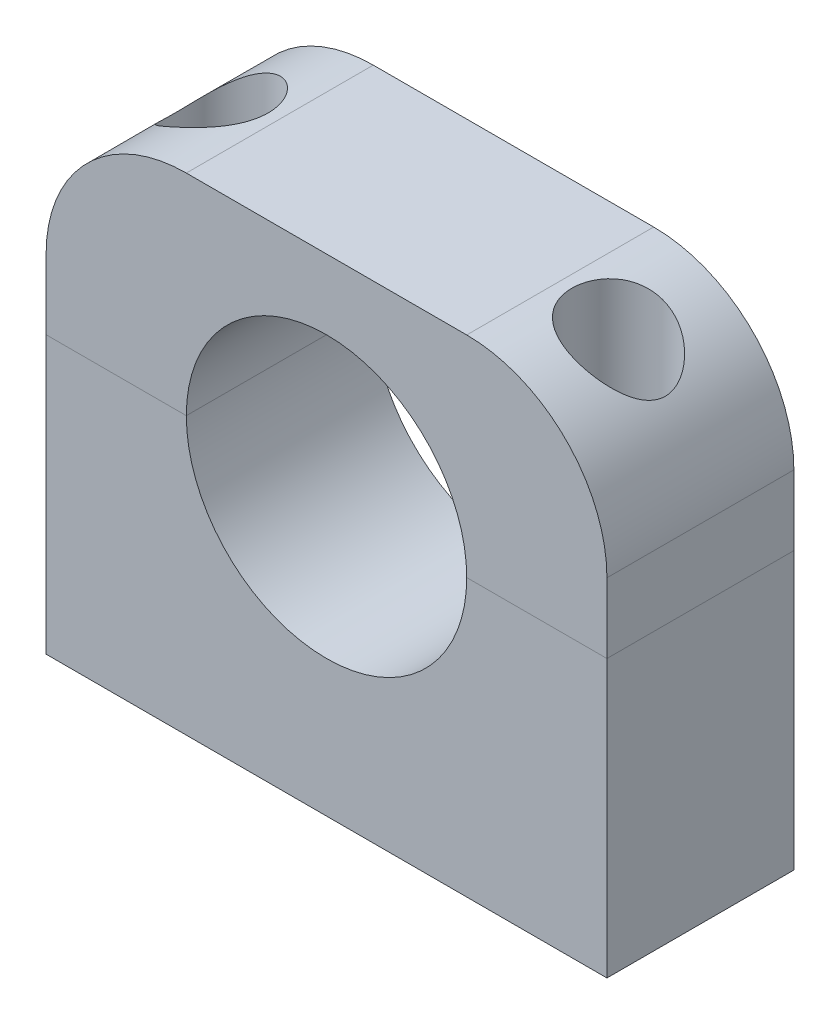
ISO-10303-21;
HEADER;
FILE_DESCRIPTION(('STEP AP214'),'2;1');
FILE_NAME('part.step','',(''),(''),'','','');
FILE_SCHEMA(('AUTOMOTIVE_DESIGN { 1 0 10303 214 1 1 1 1 }'));
ENDSEC;
DATA;
#1=APPLICATION_CONTEXT('core data for automotive mechanical design processes');
#2=APPLICATION_PROTOCOL_DEFINITION('international standard','automotive_design',2000,#1);
#3=PRODUCT_CONTEXT('',#1,'mechanical');
#4=PRODUCT('Part','Part','',(#3));
#5=PRODUCT_RELATED_PRODUCT_CATEGORY('part','',(#4));
#6=PRODUCT_DEFINITION_FORMATION('','',#4);
#7=PRODUCT_DEFINITION_CONTEXT('part definition',#1,'design');
#8=PRODUCT_DEFINITION('design','',#6,#7);
#9=PRODUCT_DEFINITION_SHAPE('','',#8);
#10=(LENGTH_UNIT() NAMED_UNIT(*) SI_UNIT(.MILLI.,.METRE.));
#11=(NAMED_UNIT(*) PLANE_ANGLE_UNIT() SI_UNIT($,.RADIAN.));
#12=(NAMED_UNIT(*) SI_UNIT($,.STERADIAN.) SOLID_ANGLE_UNIT());
#13=UNCERTAINTY_MEASURE_WITH_UNIT(LENGTH_MEASURE(1.E-05),#10,'distance_accuracy_value','');
#14=(GEOMETRIC_REPRESENTATION_CONTEXT(3) GLOBAL_UNCERTAINTY_ASSIGNED_CONTEXT((#13)) GLOBAL_UNIT_ASSIGNED_CONTEXT((#10,
#11,#12)) REPRESENTATION_CONTEXT('',''));
#15=CARTESIAN_POINT('',(0.,0.,0.));
#16=DIRECTION('',(0.,0.,1.));
#17=DIRECTION('',(1.,0.,0.));
#18=AXIS2_PLACEMENT_3D('',#15,#16,#17);
#19=CARTESIAN_POINT('',(-19.05,0.,6.35));
#20=DIRECTION('',(0.,-1.,0.));
#21=DIRECTION('',(1.,0.,0.));
#22=AXIS2_PLACEMENT_3D('',#19,#20,#21);
#23=PLANE('',#22);
#24=DIRECTION('',(-1.,0.,0.));
#25=VECTOR('',#24,1.);
#26=CARTESIAN_POINT('',(-19.05,0.,-6.35));
#27=LINE('',#26,#25);
#28=CARTESIAN_POINT('',(-9.525,0.,-6.35));
#29=VERTEX_POINT('',#28);
#30=CARTESIAN_POINT('',(-19.05,0.,-6.35));
#31=VERTEX_POINT('',#30);
#32=EDGE_CURVE('E130',#29,#31,#27,.T.);
#33=ORIENTED_EDGE('',*,*,#32,.T.);
#34=DIRECTION('',(0.,0.,-1.));
#35=VECTOR('',#34,1.);
#36=CARTESIAN_POINT('',(-19.05,0.,6.35));
#37=LINE('',#36,#35);
#38=CARTESIAN_POINT('',(-19.05,0.,6.35));
#39=VERTEX_POINT('',#38);
#40=EDGE_CURVE('E12',#39,#31,#37,.T.);
#41=ORIENTED_EDGE('',*,*,#40,.F.);
#42=DIRECTION('',(-1.,0.,0.));
#43=VECTOR('',#42,1.);
#44=CARTESIAN_POINT('',(-19.05,0.,6.35));
#45=LINE('',#44,#43);
#46=CARTESIAN_POINT('',(-9.525,0.,6.35));
#47=VERTEX_POINT('',#46);
#48=EDGE_CURVE('E141',#47,#39,#45,.T.);
#49=ORIENTED_EDGE('',*,*,#48,.F.);
#50=DIRECTION('',(0.,0.,-1.));
#51=VECTOR('',#50,1.);
#52=CARTESIAN_POINT('',(-9.525,0.,6.35));
#53=LINE('',#52,#51);
#54=EDGE_CURVE('E126',#47,#29,#53,.T.);
#55=ORIENTED_EDGE('',*,*,#54,.T.);
#56=EDGE_LOOP('',(#33,#41,#49,#55));
#57=FACE_BOUND('',#56,.T.);
#58=CARTESIAN_POINT('',(-13.4874,0.,0.));
#59=DIRECTION('',(0.,-1.,0.));
#60=DIRECTION('',(1.,0.,0.));
#61=AXIS2_PLACEMENT_3D('',#58,#59,#60);
#62=CIRCLE('',#61,3.175);
#63=CARTESIAN_POINT('',(-13.4874,0.,-3.175));
#64=VERTEX_POINT('',#63);
#65=EDGE_CURVE('E134',#64,#64,#62,.F.);
#66=ORIENTED_EDGE('',*,*,#65,.F.);
#67=EDGE_LOOP('',(#66));
#68=FACE_BOUND('',#67,.T.);
#69=ADVANCED_FACE('F43',(#57,#68),#23,.F.);
#70=CARTESIAN_POINT('',(-19.05,-18.796,6.35));
#71=DIRECTION('',(0.,1.,0.));
#72=DIRECTION('',(0.,0.,1.));
#73=AXIS2_PLACEMENT_3D('',#70,#71,#72);
#74=PLANE('',#73);
#75=CARTESIAN_POINT('',(13.4874,-18.796,0.));
#76=DIRECTION('',(0.,1.,0.));
#77=DIRECTION('',(0.,0.,1.));
#78=AXIS2_PLACEMENT_3D('',#75,#76,#77);
#79=CIRCLE('',#78,3.175);
#80=CARTESIAN_POINT('',(13.4874,-18.796,-3.175));
#81=VERTEX_POINT('',#80);
#82=EDGE_CURVE('E148',#81,#81,#79,.F.);
#83=ORIENTED_EDGE('',*,*,#82,.F.);
#84=EDGE_LOOP('',(#83));
#85=FACE_BOUND('',#84,.T.);
#86=DIRECTION('',(1.,0.,0.));
#87=VECTOR('',#86,1.);
#88=CARTESIAN_POINT('',(-19.05,-18.796,-6.35));
#89=LINE('',#88,#87);
#90=CARTESIAN_POINT('',(-19.05,-18.796,-6.35));
#91=VERTEX_POINT('',#90);
#92=CARTESIAN_POINT('',(19.05,-18.796,-6.35));
#93=VERTEX_POINT('',#92);
#94=EDGE_CURVE('E136',#91,#93,#89,.T.);
#95=ORIENTED_EDGE('',*,*,#94,.T.);
#96=DIRECTION('',(0.,0.,-1.));
#97=VECTOR('',#96,1.);
#98=CARTESIAN_POINT('',(19.05,-18.796,6.35));
#99=LINE('',#98,#97);
#100=CARTESIAN_POINT('',(19.05,-18.796,6.35));
#101=VERTEX_POINT('',#100);
#102=EDGE_CURVE('E120',#101,#93,#99,.T.);
#103=ORIENTED_EDGE('',*,*,#102,.F.);
#104=DIRECTION('',(1.,0.,0.));
#105=VECTOR('',#104,1.);
#106=CARTESIAN_POINT('',(-19.05,-18.796,6.35));
#107=LINE('',#106,#105);
#108=CARTESIAN_POINT('',(-19.05,-18.796,6.35));
#109=VERTEX_POINT('',#108);
#110=EDGE_CURVE('E111',#109,#101,#107,.T.);
#111=ORIENTED_EDGE('',*,*,#110,.F.);
#112=DIRECTION('',(0.,0.,-1.));
#113=VECTOR('',#112,1.);
#114=CARTESIAN_POINT('',(-19.05,-18.796,6.35));
#115=LINE('',#114,#113);
#116=EDGE_CURVE('E52',#109,#91,#115,.T.);
#117=ORIENTED_EDGE('',*,*,#116,.T.);
#118=EDGE_LOOP('',(#95,#103,#111,#117));
#119=FACE_BOUND('',#118,.T.);
#120=CARTESIAN_POINT('',(-13.4874,-18.796,0.));
#121=DIRECTION('',(0.,1.,0.));
#122=DIRECTION('',(0.,0.,1.));
#123=AXIS2_PLACEMENT_3D('',#120,#121,#122);
#124=CIRCLE('',#123,3.175);
#125=CARTESIAN_POINT('',(-13.4874,-18.796,-3.175));
#126=VERTEX_POINT('',#125);
#127=EDGE_CURVE('E46',#126,#126,#124,.F.);
#128=ORIENTED_EDGE('',*,*,#127,.F.);
#129=EDGE_LOOP('',(#128));
#130=FACE_BOUND('',#129,.T.);
#131=ADVANCED_FACE('F165',(#85,#119,#130),#74,.F.);
#132=CARTESIAN_POINT('',(9.525,0.,6.35));
#133=DIRECTION('',(0.,-1.,0.));
#134=DIRECTION('',(1.,0.,0.));
#135=AXIS2_PLACEMENT_3D('',#132,#133,#134);
#136=PLANE('',#135);
#137=DIRECTION('',(-1.,0.,0.));
#138=VECTOR('',#137,1.);
#139=CARTESIAN_POINT('',(9.525,0.,-6.35));
#140=LINE('',#139,#138);
#141=CARTESIAN_POINT('',(19.05,0.,-6.35));
#142=VERTEX_POINT('',#141);
#143=CARTESIAN_POINT('',(9.525,0.,-6.35));
#144=VERTEX_POINT('',#143);
#145=EDGE_CURVE('E84',#142,#144,#140,.T.);
#146=ORIENTED_EDGE('',*,*,#145,.T.);
#147=DIRECTION('',(0.,0.,-1.));
#148=VECTOR('',#147,1.);
#149=CARTESIAN_POINT('',(9.525,0.,6.35));
#150=LINE('',#149,#148);
#151=CARTESIAN_POINT('',(9.525,0.,6.35));
#152=VERTEX_POINT('',#151);
#153=EDGE_CURVE('E121',#152,#144,#150,.T.);
#154=ORIENTED_EDGE('',*,*,#153,.F.);
#155=DIRECTION('',(-1.,0.,0.));
#156=VECTOR('',#155,1.);
#157=CARTESIAN_POINT('',(9.525,0.,6.35));
#158=LINE('',#157,#156);
#159=CARTESIAN_POINT('',(19.05,0.,6.35));
#160=VERTEX_POINT('',#159);
#161=EDGE_CURVE('E109',#160,#152,#158,.T.);
#162=ORIENTED_EDGE('',*,*,#161,.F.);
#163=DIRECTION('',(0.,0.,-1.));
#164=VECTOR('',#163,1.);
#165=CARTESIAN_POINT('',(19.05,0.,6.35));
#166=LINE('',#165,#164);
#167=EDGE_CURVE('E116',#160,#142,#166,.T.);
#168=ORIENTED_EDGE('',*,*,#167,.T.);
#169=EDGE_LOOP('',(#146,#154,#162,#168));
#170=FACE_BOUND('',#169,.T.);
#171=CARTESIAN_POINT('',(13.4874,0.,0.));
#172=DIRECTION('',(0.,-1.,0.));
#173=DIRECTION('',(1.,0.,0.));
#174=AXIS2_PLACEMENT_3D('',#171,#172,#173);
#175=CIRCLE('',#174,3.175);
#176=CARTESIAN_POINT('',(13.4874,0.,-3.175));
#177=VERTEX_POINT('',#176);
#178=EDGE_CURVE('E146',#177,#177,#175,.F.);
#179=ORIENTED_EDGE('',*,*,#178,.F.);
#180=EDGE_LOOP('',(#179));
#181=FACE_BOUND('',#180,.T.);
#182=ADVANCED_FACE('F123',(#170,#181),#136,.F.);
#183=CARTESIAN_POINT('',(-19.05,0.,6.35));
#184=DIRECTION('',(1.,0.,0.));
#185=DIRECTION('',(0.,0.,-1.));
#186=AXIS2_PLACEMENT_3D('',#183,#184,#185);
#187=PLANE('',#186);
#188=DIRECTION('',(0.,-1.,0.));
#189=VECTOR('',#188,1.);
#190=CARTESIAN_POINT('',(-19.05,0.,-6.35));
#191=LINE('',#190,#189);
#192=EDGE_CURVE('E133',#31,#91,#191,.T.);
#193=ORIENTED_EDGE('',*,*,#192,.T.);
#194=ORIENTED_EDGE('',*,*,#116,.F.);
#195=DIRECTION('',(0.,-1.,0.));
#196=VECTOR('',#195,1.);
#197=CARTESIAN_POINT('',(-19.05,0.,6.35));
#198=LINE('',#197,#196);
#199=EDGE_CURVE('E98',#39,#109,#198,.T.);
#200=ORIENTED_EDGE('',*,*,#199,.F.);
#201=ORIENTED_EDGE('',*,*,#40,.T.);
#202=EDGE_LOOP('',(#193,#194,#200,#201));
#203=FACE_BOUND('',#202,.T.);
#204=ADVANCED_FACE('F162',(#203),#187,.F.);
#205=CARTESIAN_POINT('',(19.05,-18.796,6.35));
#206=DIRECTION('',(-1.,0.,0.));
#207=DIRECTION('',(0.,0.,1.));
#208=AXIS2_PLACEMENT_3D('',#205,#206,#207);
#209=PLANE('',#208);
#210=DIRECTION('',(0.,1.,0.));
#211=VECTOR('',#210,1.);
#212=CARTESIAN_POINT('',(19.05,-18.796,-6.35));
#213=LINE('',#212,#211);
#214=EDGE_CURVE('E119',#93,#142,#213,.T.);
#215=ORIENTED_EDGE('',*,*,#214,.T.);
#216=ORIENTED_EDGE('',*,*,#167,.F.);
#217=DIRECTION('',(0.,1.,0.));
#218=VECTOR('',#217,1.);
#219=CARTESIAN_POINT('',(19.05,-18.796,6.35));
#220=LINE('',#219,#218);
#221=EDGE_CURVE('E105',#101,#160,#220,.T.);
#222=ORIENTED_EDGE('',*,*,#221,.F.);
#223=ORIENTED_EDGE('',*,*,#102,.T.);
#224=EDGE_LOOP('',(#215,#216,#222,#223));
#225=FACE_BOUND('',#224,.T.);
#226=ADVANCED_FACE('F117',(#225),#209,.F.);
#227=CARTESIAN_POINT('',(0.,0.,6.35));
#228=DIRECTION('',(0.,0.,-1.));
#229=DIRECTION('',(-1.,0.,0.));
#230=AXIS2_PLACEMENT_3D('',#227,#228,#229);
#231=CYLINDRICAL_SURFACE('',#230,9.525);
#232=CARTESIAN_POINT('',(0.,0.,-6.35));
#233=DIRECTION('',(0.,0.,-1.));
#234=DIRECTION('',(1.,0.,0.));
#235=AXIS2_PLACEMENT_3D('',#232,#233,#234);
#236=CIRCLE('',#235,9.525);
#237=EDGE_CURVE('E90',#144,#29,#236,.T.);
#238=ORIENTED_EDGE('',*,*,#237,.T.);
#239=ORIENTED_EDGE('',*,*,#54,.F.);
#240=CARTESIAN_POINT('',(0.,0.,6.35));
#241=DIRECTION('',(0.,0.,-1.));
#242=DIRECTION('',(1.,0.,0.));
#243=AXIS2_PLACEMENT_3D('',#240,#241,#242);
#244=CIRCLE('',#243,9.525);
#245=EDGE_CURVE('E61',#152,#47,#244,.T.);
#246=ORIENTED_EDGE('',*,*,#245,.F.);
#247=ORIENTED_EDGE('',*,*,#153,.T.);
#248=EDGE_LOOP('',(#238,#239,#246,#247));
#249=FACE_BOUND('',#248,.T.);
#250=ADVANCED_FACE('F172',(#249),#231,.F.);
#251=CARTESIAN_POINT('',(0.,0.,6.35));
#252=DIRECTION('',(0.,0.,1.));
#253=DIRECTION('',(1.,0.,0.));
#254=AXIS2_PLACEMENT_3D('',#251,#252,#253);
#255=PLANE('',#254);
#256=ORIENTED_EDGE('',*,*,#48,.T.);
#257=ORIENTED_EDGE('',*,*,#199,.T.);
#258=ORIENTED_EDGE('',*,*,#110,.T.);
#259=ORIENTED_EDGE('',*,*,#221,.T.);
#260=ORIENTED_EDGE('',*,*,#161,.T.);
#261=ORIENTED_EDGE('',*,*,#245,.T.);
#262=EDGE_LOOP('',(#256,#257,#258,#259,#260,#261));
#263=FACE_BOUND('',#262,.T.);
#264=ADVANCED_FACE('F107',(#263),#255,.T.);
#265=CARTESIAN_POINT('',(0.,0.,-6.35));
#266=DIRECTION('',(0.,0.,1.));
#267=DIRECTION('',(1.,0.,0.));
#268=AXIS2_PLACEMENT_3D('',#265,#266,#267);
#269=PLANE('',#268);
#270=ORIENTED_EDGE('',*,*,#32,.F.);
#271=ORIENTED_EDGE('',*,*,#237,.F.);
#272=ORIENTED_EDGE('',*,*,#145,.F.);
#273=ORIENTED_EDGE('',*,*,#214,.F.);
#274=ORIENTED_EDGE('',*,*,#94,.F.);
#275=ORIENTED_EDGE('',*,*,#192,.F.);
#276=EDGE_LOOP('',(#270,#271,#272,#273,#274,#275));
#277=FACE_BOUND('',#276,.T.);
#278=ADVANCED_FACE('F169',(#277),#269,.F.);
#279=CARTESIAN_POINT('',(13.4874,17.78,0.));
#280=DIRECTION('',(0.,-1.,0.));
#281=DIRECTION('',(0.,0.,-1.));
#282=AXIS2_PLACEMENT_3D('',#279,#280,#281);
#283=CYLINDRICAL_SURFACE('',#282,3.175);
#284=CARTESIAN_POINT('',(13.4874,0.,-3.175));
#285=CARTESIAN_POINT('',(13.4874,-0.195791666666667,-3.175));
#286=CARTESIAN_POINT('',(13.4874,-0.391583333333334,-3.175));
#287=CARTESIAN_POINT('',(13.4874,-0.783166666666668,-3.175));
#288=CARTESIAN_POINT('',(13.4874,-0.978958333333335,-3.175));
#289=CARTESIAN_POINT('',(13.4874,-1.37054166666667,-3.175));
#290=CARTESIAN_POINT('',(13.4874,-1.56633333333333,-3.175));
#291=CARTESIAN_POINT('',(13.4874,-1.95791666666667,-3.175));
#292=CARTESIAN_POINT('',(13.4874,-2.15370833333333,-3.175));
#293=CARTESIAN_POINT('',(13.4874,-2.54529166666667,-3.175));
#294=CARTESIAN_POINT('',(13.4874,-2.74108333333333,-3.175));
#295=CARTESIAN_POINT('',(13.4874,-3.13266666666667,-3.175));
#296=CARTESIAN_POINT('',(13.4874,-3.32845833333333,-3.175));
#297=CARTESIAN_POINT('',(13.4874,-3.72004166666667,-3.175));
#298=CARTESIAN_POINT('',(13.4874,-3.91583333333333,-3.175));
#299=CARTESIAN_POINT('',(13.4874,-4.30741666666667,-3.175));
#300=CARTESIAN_POINT('',(13.4874,-4.50320833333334,-3.175));
#301=CARTESIAN_POINT('',(13.4874,-4.89479166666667,-3.175));
#302=CARTESIAN_POINT('',(13.4874,-5.09058333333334,-3.175));
#303=CARTESIAN_POINT('',(13.4874,-5.48216666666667,-3.175));
#304=CARTESIAN_POINT('',(13.4874,-5.67795833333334,-3.175));
#305=CARTESIAN_POINT('',(13.4874,-6.06954166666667,-3.175));
#306=CARTESIAN_POINT('',(13.4874,-6.26533333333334,-3.175));
#307=CARTESIAN_POINT('',(13.4874,-6.65691666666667,-3.175));
#308=CARTESIAN_POINT('',(13.4874,-6.85270833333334,-3.175));
#309=CARTESIAN_POINT('',(13.4874,-7.24429166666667,-3.175));
#310=CARTESIAN_POINT('',(13.4874,-7.44008333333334,-3.175));
#311=CARTESIAN_POINT('',(13.4874,-7.83166666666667,-3.175));
#312=CARTESIAN_POINT('',(13.4874,-8.02745833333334,-3.175));
#313=CARTESIAN_POINT('',(13.4874,-8.41904166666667,-3.175));
#314=CARTESIAN_POINT('',(13.4874,-8.61483333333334,-3.175));
#315=CARTESIAN_POINT('',(13.4874,-9.00641666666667,-3.175));
#316=CARTESIAN_POINT('',(13.4874,-9.20220833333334,-3.175));
#317=CARTESIAN_POINT('',(13.4874,-9.59379166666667,-3.175));
#318=CARTESIAN_POINT('',(13.4874,-9.78958333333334,-3.175));
#319=CARTESIAN_POINT('',(13.4874,-10.1811666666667,-3.175));
#320=CARTESIAN_POINT('',(13.4874,-10.3769583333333,-3.175));
#321=CARTESIAN_POINT('',(13.4874,-10.7685416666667,-3.175));
#322=CARTESIAN_POINT('',(13.4874,-10.9643333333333,-3.175));
#323=CARTESIAN_POINT('',(13.4874,-11.3559166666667,-3.175));
#324=CARTESIAN_POINT('',(13.4874,-11.5517083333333,-3.175));
#325=CARTESIAN_POINT('',(13.4874,-11.9432916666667,-3.175));
#326=CARTESIAN_POINT('',(13.4874,-12.1390833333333,-3.175));
#327=CARTESIAN_POINT('',(13.4874,-12.5306666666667,-3.175));
#328=CARTESIAN_POINT('',(13.4874,-12.7264583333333,-3.175));
#329=CARTESIAN_POINT('',(13.4874,-13.1180416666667,-3.175));
#330=CARTESIAN_POINT('',(13.4874,-13.3138333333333,-3.175));
#331=CARTESIAN_POINT('',(13.4874,-13.7054166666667,-3.175));
#332=CARTESIAN_POINT('',(13.4874,-13.9012083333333,-3.175));
#333=CARTESIAN_POINT('',(13.4874,-14.2927916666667,-3.175));
#334=CARTESIAN_POINT('',(13.4874,-14.4885833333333,-3.175));
#335=CARTESIAN_POINT('',(13.4874,-14.8801666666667,-3.175));
#336=CARTESIAN_POINT('',(13.4874,-15.0759583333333,-3.175));
#337=CARTESIAN_POINT('',(13.4874,-15.4675416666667,-3.175));
#338=CARTESIAN_POINT('',(13.4874,-15.6633333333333,-3.175));
#339=CARTESIAN_POINT('',(13.4874,-16.0549166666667,-3.175));
#340=CARTESIAN_POINT('',(13.4874,-16.2507083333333,-3.175));
#341=CARTESIAN_POINT('',(13.4874,-16.6422916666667,-3.175));
#342=CARTESIAN_POINT('',(13.4874,-16.8380833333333,-3.175));
#343=CARTESIAN_POINT('',(13.4874,-17.2296666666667,-3.175));
#344=CARTESIAN_POINT('',(13.4874,-17.4254583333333,-3.175));
#345=CARTESIAN_POINT('',(13.4874,-17.8170416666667,-3.175));
#346=CARTESIAN_POINT('',(13.4874,-18.0128333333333,-3.175));
#347=CARTESIAN_POINT('',(13.4874,-18.4044166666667,-3.175));
#348=CARTESIAN_POINT('',(13.4874,-18.6002083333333,-3.175));
#349=CARTESIAN_POINT('',(13.4874,-18.796,-3.175));
#350=B_SPLINE_CURVE_WITH_KNOTS('',3,(#284,#285,#286,#287,#288,#289,#290,#291,#292,#293,#294,
#295,#296,#297,#298,#299,#300,#301,#302,#303,#304,#305,#306,#307,#308,#309,#310,#311,#312,#313,
#314,#315,#316,#317,#318,#319,#320,#321,#322,#323,#324,#325,#326,#327,#328,#329,#330,#331,#332,
#333,#334,#335,#336,#337,#338,#339,#340,#341,#342,#343,#344,#345,#346,#347,#348,#349),
.UNSPECIFIED.,.F.,.F.,(4,2,2,2,2,2,2,2,2,2,2,2,2,2,2,2,2,2,2,2,2,2,2,2,2,2,2,2,2,2,2,2,4),(0.,
0.587375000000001,1.17475,1.762125,2.3495,2.936875,3.52425,4.111625,4.699,5.286375,5.87375,
6.461125,7.0485,7.635875,8.22325,8.810625,9.398,9.985375,10.57275,11.160125,11.7475,12.334875,
12.92225,13.509625,14.097,14.684375,15.27175,15.859125,16.4465,17.033875,17.62125,18.208625,
18.796),.UNSPECIFIED.);
#351=EDGE_CURVE('BSEAM219',#177,#81,#350,.T.);
#352=ORIENTED_EDGE('',*,*,#178,.T.);
#353=ORIENTED_EDGE('',*,*,#82,.T.);
#354=ORIENTED_EDGE('',*,*,#351,.T.);
#355=ORIENTED_EDGE('',*,*,#351,.F.);
#356=EDGE_LOOP('',(#352,#354,#353,#355));
#357=FACE_BOUND('',#356,.T.);
#358=ADVANCED_FACE('F219',(#357),#283,.F.);
#359=CARTESIAN_POINT('',(-13.4874,17.78,0.));
#360=DIRECTION('',(0.,-1.,0.));
#361=DIRECTION('',(0.,0.,-1.));
#362=AXIS2_PLACEMENT_3D('',#359,#360,#361);
#363=CYLINDRICAL_SURFACE('',#362,3.175);
#364=CARTESIAN_POINT('',(-13.4874,-18.796,-3.175));
#365=CARTESIAN_POINT('',(-13.4874,-18.6002083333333,-3.175));
#366=CARTESIAN_POINT('',(-13.4874,-18.4044166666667,-3.175));
#367=CARTESIAN_POINT('',(-13.4874,-18.0128333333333,-3.175));
#368=CARTESIAN_POINT('',(-13.4874,-17.8170416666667,-3.175));
#369=CARTESIAN_POINT('',(-13.4874,-17.4254583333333,-3.175));
#370=CARTESIAN_POINT('',(-13.4874,-17.2296666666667,-3.175));
#371=CARTESIAN_POINT('',(-13.4874,-16.8380833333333,-3.175));
#372=CARTESIAN_POINT('',(-13.4874,-16.6422916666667,-3.175));
#373=CARTESIAN_POINT('',(-13.4874,-16.2507083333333,-3.175));
#374=CARTESIAN_POINT('',(-13.4874,-16.0549166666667,-3.175));
#375=CARTESIAN_POINT('',(-13.4874,-15.6633333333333,-3.175));
#376=CARTESIAN_POINT('',(-13.4874,-15.4675416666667,-3.175));
#377=CARTESIAN_POINT('',(-13.4874,-15.0759583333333,-3.175));
#378=CARTESIAN_POINT('',(-13.4874,-14.8801666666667,-3.175));
#379=CARTESIAN_POINT('',(-13.4874,-14.4885833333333,-3.175));
#380=CARTESIAN_POINT('',(-13.4874,-14.2927916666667,-3.175));
#381=CARTESIAN_POINT('',(-13.4874,-13.9012083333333,-3.175));
#382=CARTESIAN_POINT('',(-13.4874,-13.7054166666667,-3.175));
#383=CARTESIAN_POINT('',(-13.4874,-13.3138333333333,-3.175));
#384=CARTESIAN_POINT('',(-13.4874,-13.1180416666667,-3.175));
#385=CARTESIAN_POINT('',(-13.4874,-12.7264583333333,-3.175));
#386=CARTESIAN_POINT('',(-13.4874,-12.5306666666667,-3.175));
#387=CARTESIAN_POINT('',(-13.4874,-12.1390833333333,-3.175));
#388=CARTESIAN_POINT('',(-13.4874,-11.9432916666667,-3.175));
#389=CARTESIAN_POINT('',(-13.4874,-11.5517083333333,-3.175));
#390=CARTESIAN_POINT('',(-13.4874,-11.3559166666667,-3.175));
#391=CARTESIAN_POINT('',(-13.4874,-10.9643333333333,-3.175));
#392=CARTESIAN_POINT('',(-13.4874,-10.7685416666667,-3.175));
#393=CARTESIAN_POINT('',(-13.4874,-10.3769583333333,-3.175));
#394=CARTESIAN_POINT('',(-13.4874,-10.1811666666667,-3.175));
#395=CARTESIAN_POINT('',(-13.4874,-9.78958333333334,-3.175));
#396=CARTESIAN_POINT('',(-13.4874,-9.59379166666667,-3.175));
#397=CARTESIAN_POINT('',(-13.4874,-9.20220833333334,-3.175));
#398=CARTESIAN_POINT('',(-13.4874,-9.00641666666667,-3.175));
#399=CARTESIAN_POINT('',(-13.4874,-8.61483333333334,-3.175));
#400=CARTESIAN_POINT('',(-13.4874,-8.41904166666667,-3.175));
#401=CARTESIAN_POINT('',(-13.4874,-8.02745833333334,-3.175));
#402=CARTESIAN_POINT('',(-13.4874,-7.83166666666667,-3.175));
#403=CARTESIAN_POINT('',(-13.4874,-7.44008333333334,-3.175));
#404=CARTESIAN_POINT('',(-13.4874,-7.24429166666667,-3.175));
#405=CARTESIAN_POINT('',(-13.4874,-6.85270833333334,-3.175));
#406=CARTESIAN_POINT('',(-13.4874,-6.65691666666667,-3.175));
#407=CARTESIAN_POINT('',(-13.4874,-6.26533333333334,-3.175));
#408=CARTESIAN_POINT('',(-13.4874,-6.06954166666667,-3.175));
#409=CARTESIAN_POINT('',(-13.4874,-5.67795833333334,-3.175));
#410=CARTESIAN_POINT('',(-13.4874,-5.48216666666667,-3.175));
#411=CARTESIAN_POINT('',(-13.4874,-5.09058333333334,-3.175));
#412=CARTESIAN_POINT('',(-13.4874,-4.89479166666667,-3.175));
#413=CARTESIAN_POINT('',(-13.4874,-4.50320833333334,-3.175));
#414=CARTESIAN_POINT('',(-13.4874,-4.30741666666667,-3.175));
#415=CARTESIAN_POINT('',(-13.4874,-3.91583333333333,-3.175));
#416=CARTESIAN_POINT('',(-13.4874,-3.72004166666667,-3.175));
#417=CARTESIAN_POINT('',(-13.4874,-3.32845833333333,-3.175));
#418=CARTESIAN_POINT('',(-13.4874,-3.13266666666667,-3.175));
#419=CARTESIAN_POINT('',(-13.4874,-2.74108333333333,-3.175));
#420=CARTESIAN_POINT('',(-13.4874,-2.54529166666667,-3.175));
#421=CARTESIAN_POINT('',(-13.4874,-2.15370833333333,-3.175));
#422=CARTESIAN_POINT('',(-13.4874,-1.95791666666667,-3.175));
#423=CARTESIAN_POINT('',(-13.4874,-1.56633333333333,-3.175));
#424=CARTESIAN_POINT('',(-13.4874,-1.37054166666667,-3.175));
#425=CARTESIAN_POINT('',(-13.4874,-0.978958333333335,-3.175));
#426=CARTESIAN_POINT('',(-13.4874,-0.783166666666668,-3.175));
#427=CARTESIAN_POINT('',(-13.4874,-0.391583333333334,-3.175));
#428=CARTESIAN_POINT('',(-13.4874,-0.195791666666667,-3.175));
#429=CARTESIAN_POINT('',(-13.4874,0.,-3.175));
#430=B_SPLINE_CURVE_WITH_KNOTS('',3,(#364,#365,#366,#367,#368,#369,#370,#371,#372,#373,#374,
#375,#376,#377,#378,#379,#380,#381,#382,#383,#384,#385,#386,#387,#388,#389,#390,#391,#392,#393,
#394,#395,#396,#397,#398,#399,#400,#401,#402,#403,#404,#405,#406,#407,#408,#409,#410,#411,#412,
#413,#414,#415,#416,#417,#418,#419,#420,#421,#422,#423,#424,#425,#426,#427,#428,#429),
.UNSPECIFIED.,.F.,.F.,(4,2,2,2,2,2,2,2,2,2,2,2,2,2,2,2,2,2,2,2,2,2,2,2,2,2,2,2,2,2,2,2,4),(0.,
0.587375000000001,1.17475,1.762125,2.3495,2.936875,3.52425,4.111625,4.699,5.286375,5.87375,
6.461125,7.0485,7.635875,8.22325,8.810625,9.398,9.985375,10.57275,11.160125,11.7475,12.334875,
12.92225,13.509625,14.097,14.684375,15.27175,15.859125,16.4465,17.033875,17.62125,18.208625,
18.796),.UNSPECIFIED.);
#431=EDGE_CURVE('BSEAM240',#126,#64,#430,.T.);
#432=ORIENTED_EDGE('',*,*,#127,.T.);
#433=ORIENTED_EDGE('',*,*,#65,.T.);
#434=ORIENTED_EDGE('',*,*,#431,.T.);
#435=ORIENTED_EDGE('',*,*,#431,.F.);
#436=EDGE_LOOP('',(#432,#434,#433,#435));
#437=FACE_BOUND('',#436,.T.);
#438=ADVANCED_FACE('F240',(#437),#363,.F.);
#439=CLOSED_SHELL('',(#69,#131,#182,#204,#226,#250,#264,#278,#358,#438));
#440=MANIFOLD_SOLID_BREP('B2',#439);
#441=CARTESIAN_POINT('',(-19.05,0.,6.35));
#442=DIRECTION('',(0.,1.,0.));
#443=DIRECTION('',(-1.,0.,0.));
#444=AXIS2_PLACEMENT_3D('',#441,#442,#443);
#445=PLANE('',#444);
#446=DIRECTION('',(1.,0.,0.));
#447=VECTOR('',#446,1.);
#448=CARTESIAN_POINT('',(-19.05,0.,-6.35));
#449=LINE('',#448,#447);
#450=CARTESIAN_POINT('',(-19.05,0.,-6.35));
#451=VERTEX_POINT('',#450);
#452=CARTESIAN_POINT('',(-9.525,0.,-6.35));
#453=VERTEX_POINT('',#452);
#454=EDGE_CURVE('E508',#451,#453,#449,.T.);
#455=ORIENTED_EDGE('',*,*,#454,.T.);
#456=DIRECTION('',(0.,0.,-1.));
#457=VECTOR('',#456,1.);
#458=CARTESIAN_POINT('',(-9.525,0.,6.35));
#459=LINE('',#458,#457);
#460=CARTESIAN_POINT('',(-9.525,0.,6.35));
#461=VERTEX_POINT('',#460);
#462=EDGE_CURVE('E347',#461,#453,#459,.T.);
#463=ORIENTED_EDGE('',*,*,#462,.F.);
#464=DIRECTION('',(1.,0.,0.));
#465=VECTOR('',#464,1.);
#466=CARTESIAN_POINT('',(-19.05,0.,6.35));
#467=LINE('',#466,#465);
#468=CARTESIAN_POINT('',(-19.05,0.,6.35));
#469=VERTEX_POINT('',#468);
#470=EDGE_CURVE('E335',#469,#461,#467,.T.);
#471=ORIENTED_EDGE('',*,*,#470,.F.);
#472=DIRECTION('',(0.,0.,-1.));
#473=VECTOR('',#472,1.);
#474=CARTESIAN_POINT('',(-19.05,0.,6.35));
#475=LINE('',#474,#473);
#476=EDGE_CURVE('E345',#469,#451,#475,.T.);
#477=ORIENTED_EDGE('',*,*,#476,.T.);
#478=EDGE_LOOP('',(#455,#463,#471,#477));
#479=FACE_BOUND('',#478,.T.);
#480=CARTESIAN_POINT('',(-13.4874,0.,0.));
#481=DIRECTION('',(0.,1.,0.));
#482=DIRECTION('',(-1.,0.,0.));
#483=AXIS2_PLACEMENT_3D('',#480,#481,#482);
#484=CIRCLE('',#483,3.175);
#485=CARTESIAN_POINT('',(-16.6624,0.,0.));
#486=VERTEX_POINT('',#485);
#487=EDGE_CURVE('E491',#486,#486,#484,.F.);
#488=ORIENTED_EDGE('',*,*,#487,.F.);
#489=EDGE_LOOP('',(#488));
#490=FACE_BOUND('',#489,.T.);
#491=ADVANCED_FACE('F261',(#479,#490),#445,.F.);
#492=CARTESIAN_POINT('',(9.525,0.,6.35));
#493=DIRECTION('',(0.,1.,0.));
#494=DIRECTION('',(-1.,0.,0.));
#495=AXIS2_PLACEMENT_3D('',#492,#493,#494);
#496=PLANE('',#495);
#497=DIRECTION('',(1.,0.,0.));
#498=VECTOR('',#497,1.);
#499=CARTESIAN_POINT('',(9.525,0.,-6.35));
#500=LINE('',#499,#498);
#501=CARTESIAN_POINT('',(9.525,0.,-6.35));
#502=VERTEX_POINT('',#501);
#503=CARTESIAN_POINT('',(19.05,0.,-6.35));
#504=VERTEX_POINT('',#503);
#505=EDGE_CURVE('E512',#502,#504,#500,.T.);
#506=ORIENTED_EDGE('',*,*,#505,.T.);
#507=DIRECTION('',(0.,0.,-1.));
#508=VECTOR('',#507,1.);
#509=CARTESIAN_POINT('',(19.05,0.,6.35));
#510=LINE('',#509,#508);
#511=CARTESIAN_POINT('',(19.05,0.,6.35));
#512=VERTEX_POINT('',#511);
#513=EDGE_CURVE('E506',#512,#504,#510,.T.);
#514=ORIENTED_EDGE('',*,*,#513,.F.);
#515=DIRECTION('',(1.,0.,0.));
#516=VECTOR('',#515,1.);
#517=CARTESIAN_POINT('',(9.525,0.,6.35));
#518=LINE('',#517,#516);
#519=CARTESIAN_POINT('',(9.525,0.,6.35));
#520=VERTEX_POINT('',#519);
#521=EDGE_CURVE('E500',#520,#512,#518,.T.);
#522=ORIENTED_EDGE('',*,*,#521,.F.);
#523=DIRECTION('',(0.,0.,-1.));
#524=VECTOR('',#523,1.);
#525=CARTESIAN_POINT('',(9.525,0.,6.35));
#526=LINE('',#525,#524);
#527=EDGE_CURVE('E359',#520,#502,#526,.T.);
#528=ORIENTED_EDGE('',*,*,#527,.T.);
#529=EDGE_LOOP('',(#506,#514,#522,#528));
#530=FACE_BOUND('',#529,.T.);
#531=CARTESIAN_POINT('',(13.4874,0.,0.));
#532=DIRECTION('',(0.,1.,0.));
#533=DIRECTION('',(-1.,0.,0.));
#534=AXIS2_PLACEMENT_3D('',#531,#532,#533);
#535=CIRCLE('',#534,3.175);
#536=CARTESIAN_POINT('',(10.3124,0.,0.));
#537=VERTEX_POINT('',#536);
#538=EDGE_CURVE('E376',#537,#537,#535,.F.);
#539=ORIENTED_EDGE('',*,*,#538,.F.);
#540=EDGE_LOOP('',(#539));
#541=FACE_BOUND('',#540,.T.);
#542=ADVANCED_FACE('F392',(#530,#541),#496,.F.);
#543=CARTESIAN_POINT('',(19.05,14.2748,6.35));
#544=DIRECTION('',(0.,-1.,0.));
#545=DIRECTION('',(1.,0.,0.));
#546=AXIS2_PLACEMENT_3D('',#543,#544,#545);
#547=PLANE('',#546);
#548=DIRECTION('',(-1.,0.,0.));
#549=VECTOR('',#548,1.);
#550=CARTESIAN_POINT('',(19.05,14.2748,6.35));
#551=LINE('',#550,#549);
#552=CARTESIAN_POINT('',(9.525,14.2748,6.35));
#553=VERTEX_POINT('',#552);
#554=CARTESIAN_POINT('',(-9.525,14.2748,6.35));
#555=VERTEX_POINT('',#554);
#556=EDGE_CURVE('E504',#553,#555,#551,.T.);
#557=ORIENTED_EDGE('',*,*,#556,.F.);
#558=DIRECTION('',(0.,0.,-1.));
#559=VECTOR('',#558,1.);
#560=CARTESIAN_POINT('',(9.525,14.2748,6.35));
#561=LINE('',#560,#559);
#562=CARTESIAN_POINT('',(9.525,14.2748,-6.35));
#563=VERTEX_POINT('',#562);
#564=EDGE_CURVE('E357',#553,#563,#561,.T.);
#565=ORIENTED_EDGE('',*,*,#564,.T.);
#566=DIRECTION('',(-1.,0.,0.));
#567=VECTOR('',#566,1.);
#568=CARTESIAN_POINT('',(19.05,14.2748,-6.35));
#569=LINE('',#568,#567);
#570=CARTESIAN_POINT('',(-9.525,14.2748,-6.35));
#571=VERTEX_POINT('',#570);
#572=EDGE_CURVE('E340',#563,#571,#569,.T.);
#573=ORIENTED_EDGE('',*,*,#572,.T.);
#574=DIRECTION('',(0.,0.,-1.));
#575=VECTOR('',#574,1.);
#576=CARTESIAN_POINT('',(-9.525,14.2748,6.35));
#577=LINE('',#576,#575);
#578=EDGE_CURVE('E355',#571,#555,#577,.F.);
#579=ORIENTED_EDGE('',*,*,#578,.T.);
#580=EDGE_LOOP('',(#557,#565,#573,#579));
#581=FACE_BOUND('',#580,.T.);
#582=ADVANCED_FACE('F389',(#581),#547,.F.);
#583=CARTESIAN_POINT('',(-19.05,14.2748,6.35));
#584=DIRECTION('',(1.,0.,0.));
#585=DIRECTION('',(0.,0.,-1.));
#586=AXIS2_PLACEMENT_3D('',#583,#584,#585);
#587=PLANE('',#586);
#588=DIRECTION('',(0.,-1.,0.));
#589=VECTOR('',#588,1.);
#590=CARTESIAN_POINT('',(-19.05,14.2748,6.35));
#591=LINE('',#590,#589);
#592=CARTESIAN_POINT('',(-19.05,4.7498,6.35));
#593=VERTEX_POINT('',#592);
#594=EDGE_CURVE('E332',#593,#469,#591,.T.);
#595=ORIENTED_EDGE('',*,*,#594,.F.);
#596=DIRECTION('',(0.,0.,-1.));
#597=VECTOR('',#596,1.);
#598=CARTESIAN_POINT('',(-19.05,4.7498,6.35));
#599=LINE('',#598,#597);
#600=CARTESIAN_POINT('',(-19.05,4.7498,-6.35));
#601=VERTEX_POINT('',#600);
#602=EDGE_CURVE('E41',#593,#601,#599,.T.);
#603=ORIENTED_EDGE('',*,*,#602,.T.);
#604=DIRECTION('',(0.,-1.,0.));
#605=VECTOR('',#604,1.);
#606=CARTESIAN_POINT('',(-19.05,14.2748,-6.35));
#607=LINE('',#606,#605);
#608=EDGE_CURVE('E353',#601,#451,#607,.T.);
#609=ORIENTED_EDGE('',*,*,#608,.T.);
#610=ORIENTED_EDGE('',*,*,#476,.F.);
#611=EDGE_LOOP('',(#595,#603,#609,#610));
#612=FACE_BOUND('',#611,.T.);
#613=ADVANCED_FACE('F351',(#612),#587,.F.);
#614=CARTESIAN_POINT('',(0.,0.,6.35));
#615=DIRECTION('',(0.,0.,-1.));
#616=DIRECTION('',(-1.,0.,0.));
#617=AXIS2_PLACEMENT_3D('',#614,#615,#616);
#618=CYLINDRICAL_SURFACE('',#617,9.525);
#619=CARTESIAN_POINT('',(0.,0.,-6.35));
#620=DIRECTION('',(0.,0.,-1.));
#621=DIRECTION('',(1.,0.,0.));
#622=AXIS2_PLACEMENT_3D('',#619,#620,#621);
#623=CIRCLE('',#622,9.525);
#624=EDGE_CURVE('E510',#453,#502,#623,.T.);
#625=ORIENTED_EDGE('',*,*,#624,.T.);
#626=ORIENTED_EDGE('',*,*,#527,.F.);
#627=CARTESIAN_POINT('',(0.,0.,6.35));
#628=DIRECTION('',(0.,0.,-1.));
#629=DIRECTION('',(1.,0.,0.));
#630=AXIS2_PLACEMENT_3D('',#627,#628,#629);
#631=CIRCLE('',#630,9.525);
#632=EDGE_CURVE('E349',#461,#520,#631,.T.);
#633=ORIENTED_EDGE('',*,*,#632,.F.);
#634=ORIENTED_EDGE('',*,*,#462,.T.);
#635=EDGE_LOOP('',(#625,#626,#633,#634));
#636=FACE_BOUND('',#635,.T.);
#637=ADVANCED_FACE('F388',(#636),#618,.F.);
#638=CARTESIAN_POINT('',(19.05,0.,6.35));
#639=DIRECTION('',(-1.,0.,0.));
#640=DIRECTION('',(0.,0.,1.));
#641=AXIS2_PLACEMENT_3D('',#638,#639,#640);
#642=PLANE('',#641);
#643=DIRECTION('',(0.,1.,0.));
#644=VECTOR('',#643,1.);
#645=CARTESIAN_POINT('',(19.05,0.,-6.35));
#646=LINE('',#645,#644);
#647=CARTESIAN_POINT('',(19.05,4.7498,-6.35));
#648=VERTEX_POINT('',#647);
#649=EDGE_CURVE('E514',#504,#648,#646,.T.);
#650=ORIENTED_EDGE('',*,*,#649,.T.);
#651=DIRECTION('',(0.,0.,-1.));
#652=VECTOR('',#651,1.);
#653=CARTESIAN_POINT('',(19.05,4.7498,6.35));
#654=LINE('',#653,#652);
#655=CARTESIAN_POINT('',(19.05,4.7498,6.35));
#656=VERTEX_POINT('',#655);
#657=EDGE_CURVE('E290',#648,#656,#654,.F.);
#658=ORIENTED_EDGE('',*,*,#657,.T.);
#659=DIRECTION('',(0.,1.,0.));
#660=VECTOR('',#659,1.);
#661=CARTESIAN_POINT('',(19.05,0.,6.35));
#662=LINE('',#661,#660);
#663=EDGE_CURVE('E502',#512,#656,#662,.T.);
#664=ORIENTED_EDGE('',*,*,#663,.F.);
#665=ORIENTED_EDGE('',*,*,#513,.T.);
#666=EDGE_LOOP('',(#650,#658,#664,#665));
#667=FACE_BOUND('',#666,.T.);
#668=ADVANCED_FACE('F395',(#667),#642,.F.);
#669=CARTESIAN_POINT('',(0.,0.,6.35));
#670=DIRECTION('',(0.,0.,1.));
#671=DIRECTION('',(1.,0.,0.));
#672=AXIS2_PLACEMENT_3D('',#669,#670,#671);
#673=PLANE('',#672);
#674=ORIENTED_EDGE('',*,*,#663,.T.);
#675=CARTESIAN_POINT('',(9.525,4.7498,6.35));
#676=DIRECTION('',(0.,0.,1.));
#677=DIRECTION('',(1.,0.,0.));
#678=AXIS2_PLACEMENT_3D('',#675,#676,#677);
#679=CIRCLE('',#678,9.525);
#680=EDGE_CURVE('E274',#656,#553,#679,.T.);
#681=ORIENTED_EDGE('',*,*,#680,.T.);
#682=ORIENTED_EDGE('',*,*,#556,.T.);
#683=CARTESIAN_POINT('',(-9.525,4.7498,6.35));
#684=DIRECTION('',(0.,0.,1.));
#685=DIRECTION('',(1.,0.,0.));
#686=AXIS2_PLACEMENT_3D('',#683,#684,#685);
#687=CIRCLE('',#686,9.525);
#688=EDGE_CURVE('E282',#555,#593,#687,.T.);
#689=ORIENTED_EDGE('',*,*,#688,.T.);
#690=ORIENTED_EDGE('',*,*,#594,.T.);
#691=ORIENTED_EDGE('',*,*,#470,.T.);
#692=ORIENTED_EDGE('',*,*,#632,.T.);
#693=ORIENTED_EDGE('',*,*,#521,.T.);
#694=EDGE_LOOP('',(#674,#681,#682,#689,#690,#691,#692,#693));
#695=FACE_BOUND('',#694,.T.);
#696=ADVANCED_FACE('F334',(#695),#673,.T.);
#697=CARTESIAN_POINT('',(0.,0.,-6.35));
#698=DIRECTION('',(0.,0.,1.));
#699=DIRECTION('',(1.,0.,0.));
#700=AXIS2_PLACEMENT_3D('',#697,#698,#699);
#701=PLANE('',#700);
#702=ORIENTED_EDGE('',*,*,#572,.F.);
#703=CARTESIAN_POINT('',(9.525,4.7498,-6.35));
#704=DIRECTION('',(0.,0.,1.));
#705=DIRECTION('',(1.,0.,0.));
#706=AXIS2_PLACEMENT_3D('',#703,#704,#705);
#707=CIRCLE('',#706,9.525);
#708=EDGE_CURVE('E367',#563,#648,#707,.F.);
#709=ORIENTED_EDGE('',*,*,#708,.T.);
#710=ORIENTED_EDGE('',*,*,#649,.F.);
#711=ORIENTED_EDGE('',*,*,#505,.F.);
#712=ORIENTED_EDGE('',*,*,#624,.F.);
#713=ORIENTED_EDGE('',*,*,#454,.F.);
#714=ORIENTED_EDGE('',*,*,#608,.F.);
#715=CARTESIAN_POINT('',(-9.525,4.7498,-6.35));
#716=DIRECTION('',(0.,0.,1.));
#717=DIRECTION('',(1.,0.,0.));
#718=AXIS2_PLACEMENT_3D('',#715,#716,#717);
#719=CIRCLE('',#718,9.525);
#720=EDGE_CURVE('E365',#601,#571,#719,.F.);
#721=ORIENTED_EDGE('',*,*,#720,.T.);
#722=EDGE_LOOP('',(#702,#709,#710,#711,#712,#713,#714,#721));
#723=FACE_BOUND('',#722,.T.);
#724=ADVANCED_FACE('F405',(#723),#701,.F.);
#725=CARTESIAN_POINT('',(13.4874,17.78,0.));
#726=DIRECTION('',(0.,-1.,0.));
#727=DIRECTION('',(0.,0.,-1.));
#728=AXIS2_PLACEMENT_3D('',#725,#726,#727);
#729=CYLINDRICAL_SURFACE('',#728,3.175);
#730=CARTESIAN_POINT('',(10.3124,14.2421983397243,0.));
#731=CARTESIAN_POINT('',(10.3123982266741,14.2421970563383,0.177411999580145));
#732=CARTESIAN_POINT('',(10.3273033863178,14.240997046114,0.354802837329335));
#733=CARTESIAN_POINT('',(10.3864844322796,14.2358079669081,0.704549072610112));
#734=CARTESIAN_POINT('',(10.4307540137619,14.2318194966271,0.876905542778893));
#735=CARTESIAN_POINT('',(10.547387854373,14.2199510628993,1.21177615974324));
#736=CARTESIAN_POINT('',(10.6197633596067,14.2120695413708,1.37428633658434));
#737=CARTESIAN_POINT('',(10.7904095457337,14.1907599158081,1.68470455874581));
#738=CARTESIAN_POINT('',(10.8886797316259,14.1773319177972,1.83261288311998));
#739=CARTESIAN_POINT('',(11.1072042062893,14.1431147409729,2.10856668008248));
#740=CARTESIAN_POINT('',(11.2273037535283,14.1223764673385,2.23674092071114));
#741=CARTESIAN_POINT('',(11.4858531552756,14.0717088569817,2.470795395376));
#742=CARTESIAN_POINT('',(11.6242995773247,14.0417812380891,2.57667978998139));
#743=CARTESIAN_POINT('',(11.9126984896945,13.9718500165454,2.76223612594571));
#744=CARTESIAN_POINT('',(12.0624702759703,13.931987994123,2.8422428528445));
#745=CARTESIAN_POINT('',(12.3699825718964,13.8414102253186,2.97660333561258));
#746=CARTESIAN_POINT('',(12.5277231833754,13.7906943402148,3.03095676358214));
#747=CARTESIAN_POINT('',(12.8487552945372,13.6777169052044,3.11460066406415));
#748=CARTESIAN_POINT('',(13.0120954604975,13.6152780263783,3.14346107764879));
#749=CARTESIAN_POINT('',(13.3371400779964,13.4804482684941,3.175650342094));
#750=CARTESIAN_POINT('',(13.4988438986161,13.4080536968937,3.1789696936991));
#751=CARTESIAN_POINT('',(13.8304070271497,13.2483737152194,3.16114457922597));
#752=CARTESIAN_POINT('',(13.9997911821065,13.1603456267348,3.13789662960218));
#753=CARTESIAN_POINT('',(14.3288054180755,12.9768667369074,3.06611294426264));
#754=CARTESIAN_POINT('',(14.4884331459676,12.8814141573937,3.01757113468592));
#755=CARTESIAN_POINT('',(14.817651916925,12.6717179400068,2.8890498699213));
#756=CARTESIAN_POINT('',(14.985402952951,12.5567392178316,2.80556720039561));
#757=CARTESIAN_POINT('',(15.303188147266,12.3245567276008,2.6111927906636));
#758=CARTESIAN_POINT('',(15.4531839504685,12.2073487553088,2.50024325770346));
#759=CARTESIAN_POINT('',(15.6713718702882,12.0270347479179,2.30691468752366));
#760=CARTESIAN_POINT('',(15.7465723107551,11.9627626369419,2.23337019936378));
#761=CARTESIAN_POINT('',(15.8901679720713,11.8363642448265,2.07810435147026));
#762=CARTESIAN_POINT('',(15.9585607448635,11.7742387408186,1.99638007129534));
#763=CARTESIAN_POINT('',(16.0877016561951,11.6537374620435,1.82497691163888));
#764=CARTESIAN_POINT('',(16.1484699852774,11.5953519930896,1.73532016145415));
#765=CARTESIAN_POINT('',(16.2616900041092,11.4839617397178,1.54787368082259));
#766=CARTESIAN_POINT('',(16.3141492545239,11.4309520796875,1.45009146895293));
#767=CARTESIAN_POINT('',(16.415842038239,11.3261142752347,1.23328027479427));
#768=CARTESIAN_POINT('',(16.4637938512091,11.2753141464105,1.11313591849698));
#769=CARTESIAN_POINT('',(16.5455655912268,11.1872632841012,0.863374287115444));
#770=CARTESIAN_POINT('',(16.5794060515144,11.1499928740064,0.733771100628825));
#771=CARTESIAN_POINT('',(16.6180073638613,11.1070979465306,0.533515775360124));
#772=CARTESIAN_POINT('',(16.6288749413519,11.0949360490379,0.465374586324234));
#773=CARTESIAN_POINT('',(16.6461856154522,11.0755026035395,0.327857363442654));
#774=CARTESIAN_POINT('',(16.6526309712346,11.0682285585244,0.258481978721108));
#775=CARTESIAN_POINT('',(16.6609314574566,11.0588528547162,0.119130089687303));
#776=CARTESIAN_POINT('',(16.6627882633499,11.0567493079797,0.0491538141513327));
#777=CARTESIAN_POINT('',(16.6618757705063,11.0577810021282,-0.0907079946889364));
#778=CARTESIAN_POINT('',(16.6591068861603,11.0609157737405,-0.160593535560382));
#779=CARTESIAN_POINT('',(16.6453065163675,11.0764948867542,-0.350318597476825));
#780=CARTESIAN_POINT('',(16.6297254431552,11.0940573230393,-0.469463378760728));
#781=CARTESIAN_POINT('',(16.5859928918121,11.1426900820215,-0.702474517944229));
#782=CARTESIAN_POINT('',(16.5578322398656,11.1737702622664,-0.81633695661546));
#783=CARTESIAN_POINT('',(16.4774675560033,11.2608300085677,-1.07966143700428));
#784=CARTESIAN_POINT('',(16.4201794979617,11.3217895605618,-1.22592006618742));
#785=CARTESIAN_POINT('',(16.2881658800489,11.4575733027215,-1.50335785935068));
#786=CARTESIAN_POINT('',(16.2133975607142,11.5324313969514,-1.63449884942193));
#787=CARTESIAN_POINT('',(16.0185568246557,11.7199968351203,-1.92750333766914));
#788=CARTESIAN_POINT('',(15.8919721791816,11.8364350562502,-2.08268574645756));
#789=CARTESIAN_POINT('',(15.6847099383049,12.0156149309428,-2.29394618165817));
#790=CARTESIAN_POINT('',(15.6126608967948,12.0761451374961,-2.36082529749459));
#791=CARTESIAN_POINT('',(15.4630433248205,12.1979239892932,-2.48737896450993));
#792=CARTESIAN_POINT('',(15.385475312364,12.2591725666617,-2.54705419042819));
#793=CARTESIAN_POINT('',(15.1423165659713,12.4448199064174,-2.71687766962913));
#794=CARTESIAN_POINT('',(14.9684853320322,12.5691697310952,-2.81557149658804));
#795=CARTESIAN_POINT('',(14.6018942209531,12.8119954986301,-2.97972546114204));
#796=CARTESIAN_POINT('',(14.4091388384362,12.9304728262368,-3.04519346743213));
#797=CARTESIAN_POINT('',(14.1066314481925,13.1013402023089,-3.1158076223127));
#798=CARTESIAN_POINT('',(14.0022549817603,13.1577767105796,-3.13480078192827));
#799=CARTESIAN_POINT('',(13.7903878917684,13.2672094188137,-3.16231229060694));
#800=CARTESIAN_POINT('',(13.6828989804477,13.3202074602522,-3.17083629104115));
#801=CARTESIAN_POINT('',(13.4658038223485,13.4221740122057,-3.17678198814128));
#802=CARTESIAN_POINT('',(13.3561990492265,13.4711452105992,-3.17421115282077));
#803=CARTESIAN_POINT('',(13.1359745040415,13.5646046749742,-3.15742147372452));
#804=CARTESIAN_POINT('',(13.0253549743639,13.60909398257,-3.14320534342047));
#805=CARTESIAN_POINT('',(12.8208742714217,13.686968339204,-3.1057228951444));
#806=CARTESIAN_POINT('',(12.7269616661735,13.7210215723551,-3.084112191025));
#807=CARTESIAN_POINT('',(12.5403507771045,13.7854528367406,-3.03201290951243));
#808=CARTESIAN_POINT('',(12.4476522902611,13.8158314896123,-3.00152583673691));
#809=CARTESIAN_POINT('',(12.2645326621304,13.8728355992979,-2.93169193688));
#810=CARTESIAN_POINT('',(12.1741101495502,13.8994633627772,-2.89235059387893));
#811=CARTESIAN_POINT('',(11.9965278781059,13.9490212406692,-2.80494487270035));
#812=CARTESIAN_POINT('',(11.9093678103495,13.9719517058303,-2.75688132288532));
#813=CARTESIAN_POINT('',(11.7497172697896,14.0116669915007,-2.65871484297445));
#814=CARTESIAN_POINT('',(11.676733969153,14.0288602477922,-2.60957520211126));
#815=CARTESIAN_POINT('',(11.534718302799,14.06065139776,-2.5050815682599));
#816=CARTESIAN_POINT('',(11.4656872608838,14.0752484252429,-2.44972551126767));
#817=CARTESIAN_POINT('',(11.3322699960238,14.1020204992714,-2.33321131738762));
#818=CARTESIAN_POINT('',(11.267881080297,14.114196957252,-2.2720565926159));
#819=CARTESIAN_POINT('',(11.1442665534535,14.1363620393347,-2.14435636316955));
#820=CARTESIAN_POINT('',(11.0850428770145,14.1463498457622,-2.07780885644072));
#821=CARTESIAN_POINT('',(10.9193387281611,14.1728412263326,-1.87495800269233));
#822=CARTESIAN_POINT('',(10.8206472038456,14.1866673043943,-1.73178219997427));
#823=CARTESIAN_POINT('',(10.6478465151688,14.2087890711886,-1.43098418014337));
#824=CARTESIAN_POINT('',(10.5737439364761,14.2170832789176,-1.2733581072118));
#825=CARTESIAN_POINT('',(10.4468890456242,14.2303171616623,-0.933590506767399));
#826=CARTESIAN_POINT('',(10.3965894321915,14.2348974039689,-0.750512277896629));
#827=CARTESIAN_POINT('',(10.3293447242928,14.2408387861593,-0.378281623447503));
#828=CARTESIAN_POINT('',(10.3124018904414,14.2421997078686,-0.189128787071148));
#829=CARTESIAN_POINT('',(10.3124,14.2421983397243,0.));
#830=B_SPLINE_CURVE_WITH_KNOTS('',3,(#730,#731,#732,#733,#734,#735,#736,#737,#738,#739,#740,
#741,#742,#743,#744,#745,#746,#747,#748,#749,#750,#751,#752,#753,#754,#755,#756,#757,#758,#759,
#760,#761,#762,#763,#764,#765,#766,#767,#768,#769,#770,#771,#772,#773,#774,#775,#776,#777,#778,
#779,#780,#781,#782,#783,#784,#785,#786,#787,#788,#789,#790,#791,#792,#793,#794,#795,#796,#797,
#798,#799,#800,#801,#802,#803,#804,#805,#806,#807,#808,#809,#810,#811,#812,#813,#814,#815,#816,
#817,#818,#819,#820,#821,#822,#823,#824,#825,#826,#827,#828,#829),.UNSPECIFIED.,.T.,.F.,(4,2,2,
2,2,2,2,2,2,2,2,2,2,2,2,2,2,2,2,2,2,2,2,2,2,2,2,2,2,2,2,2,2,2,2,2,2,2,2,2,2,2,2,2,2,2,2,2,2,4),
(0.,0.531573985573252,1.06303387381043,1.59470663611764,2.12636923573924,2.65440044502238,
3.18233300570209,3.7031336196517,4.22394089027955,4.75337487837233,5.28300576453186,
5.85765689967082,6.43244609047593,7.08943873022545,7.74782566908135,8.11723151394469,
8.48676972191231,8.85530770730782,9.22350839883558,9.63904481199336,10.0539744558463,
10.2638992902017,10.4737168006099,10.6834576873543,10.893179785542,11.255672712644,
11.6184304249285,12.1210724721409,12.6249571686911,13.3160005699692,13.6620718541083,
14.008110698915,14.7111999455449,15.4141226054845,15.7741685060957,16.1340199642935,
16.4936292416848,16.8531547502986,17.1593404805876,17.465474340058,17.7714191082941,
18.0773348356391,18.345948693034,18.614652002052,18.8831981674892,19.1518444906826,
19.6725156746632,20.1933261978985,20.7599684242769,21.3266490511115),.UNSPECIFIED.);
#831=CARTESIAN_POINT('',(10.3124,14.2421983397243,0.));
#832=VERTEX_POINT('',#831);
#833=EDGE_CURVE('E371',#832,#832,#830,.T.);
#834=ORIENTED_EDGE('',*,*,#833,.T.);
#835=EDGE_LOOP('',(#834));
#836=FACE_BOUND('',#835,.T.);
#837=ORIENTED_EDGE('',*,*,#538,.T.);
#838=EDGE_LOOP('',(#837));
#839=FACE_BOUND('',#838,.T.);
#840=ADVANCED_FACE('F377',(#836,#839),#729,.F.);
#841=CARTESIAN_POINT('',(-13.4874,17.78,0.));
#842=DIRECTION('',(0.,-1.,0.));
#843=DIRECTION('',(0.,0.,-1.));
#844=AXIS2_PLACEMENT_3D('',#841,#842,#843);
#845=CYLINDRICAL_SURFACE('',#844,3.175);
#846=CARTESIAN_POINT('',(-16.6624,11.0571882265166,0.));
#847=CARTESIAN_POINT('',(-16.6623994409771,11.0571891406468,0.0710038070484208));
#848=CARTESIAN_POINT('',(-16.6600115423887,11.0598941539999,0.142028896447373));
#849=CARTESIAN_POINT('',(-16.6505215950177,11.0706082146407,0.283395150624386));
#850=CARTESIAN_POINT('',(-16.6434160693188,11.078621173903,0.353735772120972));
#851=CARTESIAN_POINT('',(-16.6246477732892,11.099668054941,0.493217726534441));
#852=CARTESIAN_POINT('',(-16.612974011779,11.1127140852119,0.562355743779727));
#853=CARTESIAN_POINT('',(-16.5853382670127,11.1433650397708,0.698752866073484));
#854=CARTESIAN_POINT('',(-16.5693738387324,11.1609725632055,0.766010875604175));
#855=CARTESIAN_POINT('',(-16.5159450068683,11.2193490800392,0.962714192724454));
#856=CARTESIAN_POINT('',(-16.4726869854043,11.2659708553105,1.08890746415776));
#857=CARTESIAN_POINT('',(-16.3730586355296,11.3705961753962,1.33069943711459));
#858=CARTESIAN_POINT('',(-16.3166839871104,11.4286034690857,1.44629463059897));
#859=CARTESIAN_POINT('',(-16.1589728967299,11.586040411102,1.72668593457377));
#860=CARTESIAN_POINT('',(-16.0498481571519,11.6908537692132,1.88409649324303));
#861=CARTESIAN_POINT('',(-15.8092996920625,11.90939273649,2.17369186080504));
#862=CARTESIAN_POINT('',(-15.6778350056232,12.0231345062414,2.3058293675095));
#863=CARTESIAN_POINT('',(-15.3919543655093,12.2557477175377,2.54737369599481));
#864=CARTESIAN_POINT('',(-15.2370684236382,12.374676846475,2.65616777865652));
#865=CARTESIAN_POINT('',(-14.9088355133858,12.6098647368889,2.84534109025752));
#866=CARTESIAN_POINT('',(-14.735490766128,12.7261238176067,2.92572373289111));
#867=CARTESIAN_POINT('',(-14.4545677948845,12.9008051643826,3.02596252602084));
#868=CARTESIAN_POINT('',(-14.3523736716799,12.9617754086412,3.05679414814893));
#869=CARTESIAN_POINT('',(-14.1438441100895,13.080843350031,3.10825150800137));
#870=CARTESIAN_POINT('',(-14.0375106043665,13.1389423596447,3.12888194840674));
#871=CARTESIAN_POINT('',(-13.8214985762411,13.2515977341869,3.15925562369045));
#872=CARTESIAN_POINT('',(-13.7118211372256,13.3061552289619,3.16900234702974));
#873=CARTESIAN_POINT('',(-13.4900917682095,13.4111338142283,3.17693491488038));
#874=CARTESIAN_POINT('',(-13.3780403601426,13.4615558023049,3.17512327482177));
#875=CARTESIAN_POINT('',(-13.1669092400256,13.5517092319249,3.16032681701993));
#876=CARTESIAN_POINT('',(-13.0679624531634,13.5919886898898,3.14876971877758));
#877=CARTESIAN_POINT('',(-12.8701716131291,13.6686954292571,3.11603863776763));
#878=CARTESIAN_POINT('',(-12.7713275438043,13.7051234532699,3.09486651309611));
#879=CARTESIAN_POINT('',(-12.5749044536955,13.773908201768,3.04274428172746));
#880=CARTESIAN_POINT('',(-12.4773243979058,13.8062684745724,3.01180278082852));
#881=CARTESIAN_POINT('',(-12.2845166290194,13.8668664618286,2.94011393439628));
#882=CARTESIAN_POINT('',(-12.1892885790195,13.8951047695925,2.8993680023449));
#883=CARTESIAN_POINT('',(-12.0157790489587,13.943741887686,2.8147638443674));
#884=CARTESIAN_POINT('',(-11.9370228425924,13.964684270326,2.77218577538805));
#885=CARTESIAN_POINT('',(-11.7828470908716,14.0036681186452,2.68014677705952));
#886=CARTESIAN_POINT('',(-11.707428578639,14.021708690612,2.63068373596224));
#887=CARTESIAN_POINT('',(-11.5607279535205,14.0550185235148,2.52521523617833));
#888=CARTESIAN_POINT('',(-11.4894433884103,14.0702894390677,2.46921371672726));
#889=CARTESIAN_POINT('',(-11.3516345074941,14.0982748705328,2.35103955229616));
#890=CARTESIAN_POINT('',(-11.2851119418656,14.1109884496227,2.28886465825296));
#891=CARTESIAN_POINT('',(-11.1004394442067,14.1444089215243,2.10065096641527));
#892=CARTESIAN_POINT('',(-10.9891966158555,14.162123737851,1.96713631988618));
#893=CARTESIAN_POINT('',(-10.7897936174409,14.1909935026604,1.6833514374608));
#894=CARTESIAN_POINT('',(-10.7016330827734,14.2021485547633,1.53308146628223));
#895=CARTESIAN_POINT('',(-10.5504674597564,14.2197465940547,1.21886548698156));
#896=CARTESIAN_POINT('',(-10.4876344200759,14.2261575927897,1.05483479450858));
#897=CARTESIAN_POINT('',(-10.3898294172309,14.2355856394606,0.718577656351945));
#898=CARTESIAN_POINT('',(-10.3548593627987,14.2386024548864,0.546350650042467));
#899=CARTESIAN_POINT('',(-10.3135182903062,14.2421290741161,0.196307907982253));
#900=CARTESIAN_POINT('',(-10.3075056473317,14.2426074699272,0.0184494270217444));
#901=CARTESIAN_POINT('',(-10.3252280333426,14.2411294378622,-0.335773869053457));
#902=CARTESIAN_POINT('',(-10.3489642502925,14.2391729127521,-0.512138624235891));
#903=CARTESIAN_POINT('',(-10.4256167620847,14.2322040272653,-0.858913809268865));
#904=CARTESIAN_POINT('',(-10.4786211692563,14.2271824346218,-1.02930459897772));
#905=CARTESIAN_POINT('',(-10.6122975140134,14.2127752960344,-1.35867376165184));
#906=CARTESIAN_POINT('',(-10.692968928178,14.2033898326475,-1.51765235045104));
#907=CARTESIAN_POINT('',(-10.8790081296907,14.1785334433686,-1.81881360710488));
#908=CARTESIAN_POINT('',(-10.9842501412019,14.1630932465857,-1.96107644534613));
#909=CARTESIAN_POINT('',(-11.2162012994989,14.1241930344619,-2.22558043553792));
#910=CARTESIAN_POINT('',(-11.3429067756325,14.1007343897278,-2.3478250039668));
#911=CARTESIAN_POINT('',(-11.6115027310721,14.0444573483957,-2.56735212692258));
#912=CARTESIAN_POINT('',(-11.7531555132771,14.0117747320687,-2.6649605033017));
#913=CARTESIAN_POINT('',(-12.0481258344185,13.9358014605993,-2.83515580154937));
#914=CARTESIAN_POINT('',(-12.2014423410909,13.8925117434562,-2.90774493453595));
#915=CARTESIAN_POINT('',(-12.5146081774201,13.7949515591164,-3.0269455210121));
#916=CARTESIAN_POINT('',(-12.6744614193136,13.7406744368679,-3.0735411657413));
#917=CARTESIAN_POINT('',(-12.9956519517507,13.6216408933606,-3.14098156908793));
#918=CARTESIAN_POINT('',(-13.1569896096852,13.5568818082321,-3.16181977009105));
#919=CARTESIAN_POINT('',(-13.4863453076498,13.4139479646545,-3.17953036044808));
#920=CARTESIAN_POINT('',(-13.65419408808,13.3352062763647,-3.17491241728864));
#921=CARTESIAN_POINT('',(-13.9828831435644,13.1692343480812,-3.14045684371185));
#922=CARTESIAN_POINT('',(-14.1437211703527,13.0820014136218,-3.11061118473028));
#923=CARTESIAN_POINT('',(-14.4756553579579,12.8896978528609,-3.02276429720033));
#924=CARTESIAN_POINT('',(-14.6454307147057,12.7837730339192,-2.96164902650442));
#925=CARTESIAN_POINT('',(-14.9701076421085,12.5673852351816,-2.8132103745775));
#926=CARTESIAN_POINT('',(-15.1249899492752,12.4569166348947,-2.72585363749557));
#927=CARTESIAN_POINT('',(-15.4391471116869,12.2192378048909,-2.51244924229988));
#928=CARTESIAN_POINT('',(-15.5958237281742,12.0919146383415,-2.38263511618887));
#929=CARTESIAN_POINT('',(-15.8118269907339,11.9059546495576,-2.16519934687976));
#930=CARTESIAN_POINT('',(-15.8806665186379,11.8447984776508,-2.0889245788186));
#931=CARTESIAN_POINT('',(-16.0115499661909,11.7253372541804,-1.92872586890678));
#932=CARTESIAN_POINT('',(-16.0735970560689,11.6670308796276,-1.84480552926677));
#933=CARTESIAN_POINT('',(-16.2105576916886,11.5351391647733,-1.63867062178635));
#934=CARTESIAN_POINT('',(-16.2824473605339,11.4632872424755,-1.51328430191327));
#935=CARTESIAN_POINT('',(-16.4102731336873,11.3321270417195,-1.24857837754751));
#936=CARTESIAN_POINT('',(-16.4662345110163,11.272798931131,-1.10928132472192));
#937=CARTESIAN_POINT('',(-16.5495545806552,11.1828581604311,-0.847735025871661));
#938=CARTESIAN_POINT('',(-16.5804160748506,11.1488590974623,-0.727782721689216));
#939=CARTESIAN_POINT('',(-16.6280715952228,11.0959253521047,-0.482026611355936));
#940=CARTESIAN_POINT('',(-16.6449062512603,11.0769471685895,-0.356240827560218));
#941=CARTESIAN_POINT('',(-16.6568648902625,11.0634466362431,-0.191287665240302));
#942=CARTESIAN_POINT('',(-16.658937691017,11.0611041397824,-0.153106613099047));
#943=CARTESIAN_POINT('',(-16.6617055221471,11.0579745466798,-0.0766191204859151));
#944=CARTESIAN_POINT('',(-16.6624003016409,11.0571877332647,-0.0383126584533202));
#945=CARTESIAN_POINT('',(-16.6624,11.0571882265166,0.));
#946=B_SPLINE_CURVE_WITH_KNOTS('',3,(#846,#847,#848,#849,#850,#851,#852,#853,#854,#855,#856,
#857,#858,#859,#860,#861,#862,#863,#864,#865,#866,#867,#868,#869,#870,#871,#872,#873,#874,#875,
#876,#877,#878,#879,#880,#881,#882,#883,#884,#885,#886,#887,#888,#889,#890,#891,#892,#893,#894,
#895,#896,#897,#898,#899,#900,#901,#902,#903,#904,#905,#906,#907,#908,#909,#910,#911,#912,#913,
#914,#915,#916,#917,#918,#919,#920,#921,#922,#923,#924,#925,#926,#927,#928,#929,#930,#931,#932,
#933,#934,#935,#936,#937,#938,#939,#940,#941,#942,#943,#944,#945),.UNSPECIFIED.,.T.,.F.,(4,2,2,
2,2,2,2,2,2,2,2,2,2,2,2,2,2,2,2,2,2,2,2,2,2,2,2,2,2,2,2,2,2,2,2,2,2,2,2,2,2,2,2,2,2,2,2,2,2,4),
(0.,0.212958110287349,0.426073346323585,0.639704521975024,0.853457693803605,1.27545738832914,
1.69759626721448,2.34905895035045,3.00172925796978,3.66986338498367,4.33791720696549,
4.70626179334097,5.07443641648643,5.44249299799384,5.81046948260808,6.13236138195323,
6.45419110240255,6.77573811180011,7.09723879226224,7.37272383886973,7.64829356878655,
7.92369812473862,8.19920338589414,8.72057887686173,9.24194613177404,9.76679763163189,
10.2916850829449,10.8230521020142,11.3544403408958,11.8874371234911,12.4204238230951,
12.9507397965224,13.4809651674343,14.003759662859,14.5265079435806,15.0495738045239,
15.5727728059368,16.1269160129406,16.6812356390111,17.3064844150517,17.9325313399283,
18.6490262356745,19.0073588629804,19.3655235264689,19.8481787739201,20.3300638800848,
20.7139149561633,21.0966502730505,21.2115385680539,21.3264477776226),.UNSPECIFIED.);
#947=CARTESIAN_POINT('',(-16.6624,11.0571882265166,0.));
#948=VERTEX_POINT('',#947);
#949=EDGE_CURVE('E266',#948,#948,#946,.T.);
#950=ORIENTED_EDGE('',*,*,#949,.T.);
#951=EDGE_LOOP('',(#950));
#952=FACE_BOUND('',#951,.T.);
#953=ORIENTED_EDGE('',*,*,#487,.T.);
#954=EDGE_LOOP('',(#953));
#955=FACE_BOUND('',#954,.T.);
#956=ADVANCED_FACE('F384',(#952,#955),#845,.F.);
#957=CARTESIAN_POINT('',(9.525,4.7498,6.35));
#958=DIRECTION('',(0.,0.,-1.));
#959=DIRECTION('',(-1.,0.,0.));
#960=AXIS2_PLACEMENT_3D('',#957,#958,#959);
#961=CYLINDRICAL_SURFACE('',#960,9.525);
#962=ORIENTED_EDGE('',*,*,#680,.F.);
#963=ORIENTED_EDGE('',*,*,#657,.F.);
#964=ORIENTED_EDGE('',*,*,#708,.F.);
#965=ORIENTED_EDGE('',*,*,#564,.F.);
#966=EDGE_LOOP('',(#962,#963,#964,#965));
#967=FACE_BOUND('',#966,.T.);
#968=ORIENTED_EDGE('',*,*,#833,.F.);
#969=EDGE_LOOP('',(#968));
#970=FACE_BOUND('',#969,.T.);
#971=ADVANCED_FACE('F380',(#967,#970),#961,.T.);
#972=CARTESIAN_POINT('',(-9.525,4.7498,6.35));
#973=DIRECTION('',(0.,0.,-1.));
#974=DIRECTION('',(-1.,0.,0.));
#975=AXIS2_PLACEMENT_3D('',#972,#973,#974);
#976=CYLINDRICAL_SURFACE('',#975,9.525);
#977=ORIENTED_EDGE('',*,*,#688,.F.);
#978=ORIENTED_EDGE('',*,*,#578,.F.);
#979=ORIENTED_EDGE('',*,*,#720,.F.);
#980=ORIENTED_EDGE('',*,*,#602,.F.);
#981=EDGE_LOOP('',(#977,#978,#979,#980));
#982=FACE_BOUND('',#981,.T.);
#983=ORIENTED_EDGE('',*,*,#949,.F.);
#984=EDGE_LOOP('',(#983));
#985=FACE_BOUND('',#984,.T.);
#986=ADVANCED_FACE('F263',(#982,#985),#976,.T.);
#987=CLOSED_SHELL('',(#491,#542,#582,#613,#637,#668,#696,#724,#840,#956,#971,#986));
#988=MANIFOLD_SOLID_BREP('B6',#987);
#989=ADVANCED_BREP_SHAPE_REPRESENTATION('',(#18,#440,#988),#14);
#990=SHAPE_DEFINITION_REPRESENTATION(#9,#989);
ENDSEC;
END-ISO-10303-21;
